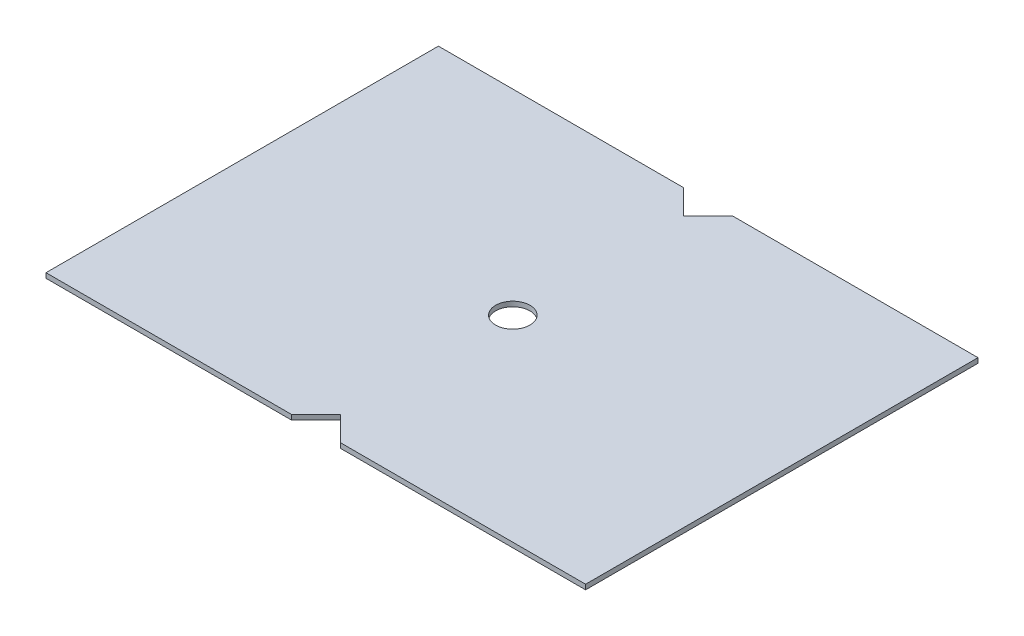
from build123d import *

# Parameters (mm, degrees)
ESQUISSE1_W             = 110
ESQUISSE1_H             = 1
EXTRUSION1_DEPTH        = 80
ESQUISSE2_R             = 3.5
ENL_V_MAT_EXTRU_1_DEPTH = 1
ENL_V_MAT_EXTRU_2_DEPTH = 1


with BuildPart() as part:
    # Esquisse1 → Extrusion1 (new body)
    with BuildSketch(Plane.XY):
        with Locations((55, 0.5)):
            Rectangle(ESQUISSE1_W, ESQUISSE1_H)
    extrude(amount=-EXTRUSION1_DEPTH)

    # Esquisse2 → Enl_v. mat.-Extru.1 (cut)
    with BuildSketch(Plane(origin=(0, 1, 0), x_dir=(-1, 0, 0), z_dir=(0, 1, 0))):
        with Locations(Location((-55.082700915, -40.082700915, 0), (0, 0, 90))):
            Circle(ESQUISSE2_R)
    extrude(amount=-ENL_V_MAT_EXTRU_1_DEPTH, mode=Mode.SUBTRACT)

    # Esquisse3 → Enl_v. mat.-Extru.2 (cut)
    with BuildSketch(Plane(origin=(0, 1, 0), x_dir=(-1, 0, 0), z_dir=(0, 1, 0))):
        Polygon((-55, -75), (-60, -80), (-50, -80), align=None)
        Polygon((-55, -5), (-60, 0), (-50, 0), align=None)
    extrude(amount=-ENL_V_MAT_EXTRU_2_DEPTH, mode=Mode.SUBTRACT)


solid = part.part
